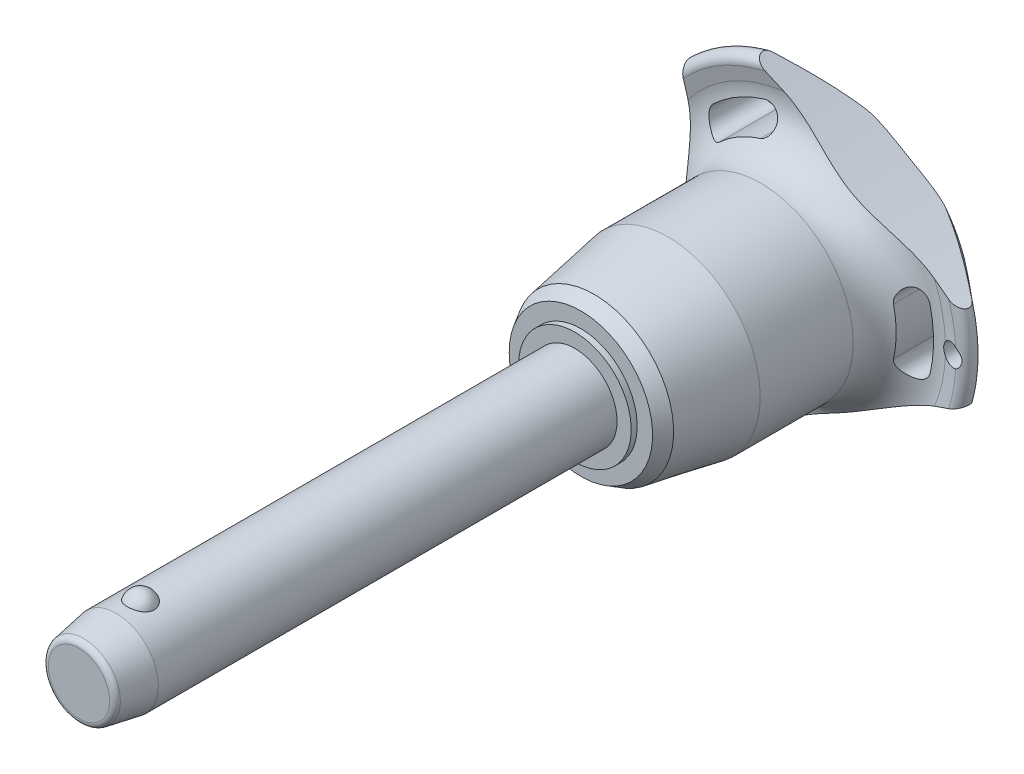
from build123d import *

# Parameters (mm, degrees)
SKETCH1_R           = 6
BOSS_EXTRUDE1_DEPTH = 60
SKETCH2_R           = 5.15
BOSS_EXTRUDE2_DEPTH = 39.7
BOSS_EXTRUDE3_START = 10.6
SKETCH1_2_R         = 6
BOSS_EXTRUDE3_DEPTH = 10.6
CHAMFER1_SIZE       = 5.3
CHAMFER1_SIZE2      = 0.934532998
FILLET1_R           = 0.85
SKETCH6_R           = 144.275
CUT_EXTRUDE1_DEPTH  = 106.231005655
CIRPATTERN1_COUNT   = 3
SKETCH7_R           = 1.5
CUT_EXTRUDE2_DEPTH  = 106.040118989


with BuildPart() as part:
    # Sketch1 → Boss-Extrude1 (new body)
    with BuildSketch(Plane.XY):
        Circle(SKETCH1_R)
    extrude(amount=-BOSS_EXTRUDE1_DEPTH)

    # Sketch2 → Boss-Extrude2 (add)
    with BuildSketch(Plane(origin=(0, 0, -60), x_dir=(-1, 0, 0), z_dir=(0, 0, -1))):
        Circle(SKETCH2_R)
    extrude(amount=BOSS_EXTRUDE2_DEPTH)

    # Sketch3 → Revolve1 (revolve)
    with BuildSketch(Plane(origin=(0, 0, 0), x_dir=(0, 0, -1), z_dir=(1, 0, 0))):
        with BuildLine():
            Line((-1.854049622, 7.25), (-1.854049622, 3.25))
            ThreePointArc((-1.854049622, 3.25), (0.145950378, 5.25), (-1.854049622, 7.25))
        make_face()
        with BuildLine():
            Line((-1.854049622, -3.25), (-1.854049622, -7.25))
            ThreePointArc((-1.854049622, -7.25), (0.145950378, -5.25), (-1.854049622, -3.25))
        make_face()
    revolve(axis=Axis((0, -3.25, 1.854049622), (0, 1, 0)))

    # Sketch1_2 → Boss-Extrude3 (add)
    with BuildSketch(Plane.XY.offset(BOSS_EXTRUDE3_START)):
        Circle(SKETCH1_2_R)
    extrude(amount=-BOSS_EXTRUDE3_DEPTH)

    # Chamfer1
    chamfer1_edges = [part.edges().sort_by_distance(p)[0] for p in [
        (-6, 0, 10.6),
    ]]
    chamfer1_side = [part.faces().sort_by_distance(p)[0] for p in [
        (-6, 0, -24.7),
    ]]
    chamfer(chamfer1_edges, length=CHAMFER1_SIZE, length2=CHAMFER1_SIZE2, reference=chamfer1_side[0])

    # Fillet1
    fillet1_edges = [part.edges().sort_by_distance(p)[0] for p in [
        (-5.065467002, 0, 10.6),
        (5.15, 0, -99.7),
    ]]
    fillet(fillet1_edges, radius=FILLET1_R)

    # Sketch4 → Revolve2 (revolve)
    with BuildSketch(Plane(origin=(0, 0, 0), x_dir=(0, 0, -1), z_dir=(1, 0, 0)), mode=Mode.PRIVATE) as revolve2_sk:
        Polygon((60, 0), (60, 8.017240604), (60.85, 8.017240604), (60.85, 10.206249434), (62.745737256, 11.300753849), (73.233333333, 13.15), (86.466666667, 13.15), (86.466666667, 0), align=None)
    revolve(revolve2_sk.sketch.rotate(Axis((0, 0, -86.466666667), (0, 0, 1)), 90), axis=Axis((0, 0, -86.466666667), (0, 0, 1)))

    # Sketch5 → Revolve3 (revolve)
    with BuildSketch(Plane(origin=(0, 0, 0), x_dir=(0, 0, -1), z_dir=(1, 0, 0)), mode=Mode.PRIVATE) as revolve3_sk:
        with BuildLine():
            Line((92.32877039, 20.428960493), (91.910912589, 22.344207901))
            ThreePointArc((91.910912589, 22.344207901), (92.554394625, 23.677136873), (94.002586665, 23.371345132))
            Line((94.002586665, 23.371345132), (99.141488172, 17.247040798))
            ThreePointArc((99.141488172, 17.247040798), (99.7, 15.584758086), (98.978803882, 13.986322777))
            ThreePointArc((98.978803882, 13.986322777), (94.617427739, 7.589034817), (93.083333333, 0))
            Line((93.083333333, 0), (86.466666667, 0))
            Line((86.466666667, 0), (86.466666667, 13.15))
            ThreePointArc((86.466666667, 13.15), (91.139661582, 15.38660811), (92.32877039, 20.428960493))
        make_face()
    revolve(revolve3_sk.sketch.rotate(Axis((0, 0, -93.083333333), (0, 0, 1)), 90), axis=Axis((0, 0, -93.083333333), (0, 0, 1)))

    # Sketch6 → Cut-Extrude1 (cut, through all)
    with BuildSketch(Plane.XY):
        with Locations((-159.975, 0)):
            Circle(SKETCH6_R)
        with BuildLine():
            ThreePointArc((18.131206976, -4.190753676), (18.60922037, 0), (18.131206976, 4.190753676))
            ThreePointArc((18.131206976, 4.190753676), (15.94840906, 5.553949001), (14.585213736, 3.371151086))
            ThreePointArc((14.585213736, 3.371151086), (14.969740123, 0), (14.585213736, -3.371151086))
            ThreePointArc((14.585213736, -3.371151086), (15.94840906, -5.553949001), (18.131206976, -4.190753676))
        make_face()
    cut_extrude1 = extrude(amount=-CUT_EXTRUDE1_DEPTH, mode=Mode.SUBTRACT)

    # CirPattern1: Cut-Extrude1 ×3 about axis
    cirpattern1_axis = Axis((0, 0, 0), (0, 0, 1))
    for i in range(1, CIRPATTERN1_COUNT):
        add(cut_extrude1.rotate(cirpattern1_axis, i * 360 / CIRPATTERN1_COUNT), mode=Mode.SUBTRACT)

    # Sketch7 → Cut-Extrude2 (cut, through all)
    with BuildSketch(Plane.XY):
        with Locations(Location((21.60922037, 0, 0), (0, 0, 297.620773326))):
            Circle(SKETCH7_R)
    extrude(amount=-CUT_EXTRUDE2_DEPTH, mode=Mode.SUBTRACT)


solid = part.part
